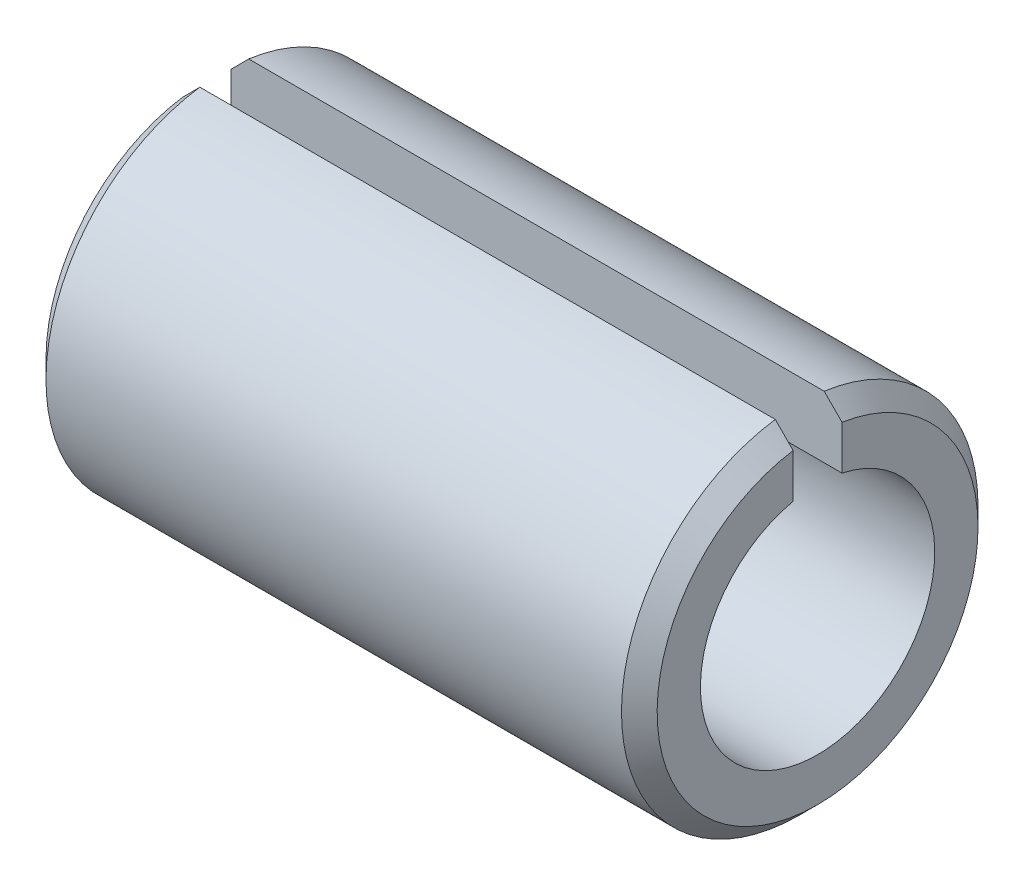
ISO-10303-21;
HEADER;
FILE_DESCRIPTION(('STEP AP214'),'2;1');
FILE_NAME('part.step','',(''),(''),'','','');
FILE_SCHEMA(('AUTOMOTIVE_DESIGN { 1 0 10303 214 1 1 1 1 }'));
ENDSEC;
DATA;
#1=APPLICATION_CONTEXT('core data for automotive mechanical design processes');
#2=APPLICATION_PROTOCOL_DEFINITION('international standard','automotive_design',2000,#1);
#3=PRODUCT_CONTEXT('',#1,'mechanical');
#4=PRODUCT('Part','Part','',(#3));
#5=PRODUCT_RELATED_PRODUCT_CATEGORY('part','',(#4));
#6=PRODUCT_DEFINITION_FORMATION('','',#4);
#7=PRODUCT_DEFINITION_CONTEXT('part definition',#1,'design');
#8=PRODUCT_DEFINITION('design','',#6,#7);
#9=PRODUCT_DEFINITION_SHAPE('','',#8);
#10=(LENGTH_UNIT() NAMED_UNIT(*) SI_UNIT(.MILLI.,.METRE.));
#11=(NAMED_UNIT(*) PLANE_ANGLE_UNIT() SI_UNIT($,.RADIAN.));
#12=(NAMED_UNIT(*) SI_UNIT($,.STERADIAN.) SOLID_ANGLE_UNIT());
#13=UNCERTAINTY_MEASURE_WITH_UNIT(LENGTH_MEASURE(1.E-05),#10,'distance_accuracy_value','');
#14=(GEOMETRIC_REPRESENTATION_CONTEXT(3) GLOBAL_UNCERTAINTY_ASSIGNED_CONTEXT((#13)) GLOBAL_UNIT_ASSIGNED_CONTEXT((#10,
#11,#12)) REPRESENTATION_CONTEXT('',''));
#15=CARTESIAN_POINT('',(0.,0.,0.));
#16=DIRECTION('',(0.,0.,1.));
#17=DIRECTION('',(1.,0.,0.));
#18=AXIS2_PLACEMENT_3D('',#15,#16,#17);
#19=CARTESIAN_POINT('',(0.,0.,0.));
#20=DIRECTION('',(-1.,0.,0.));
#21=DIRECTION('',(0.,0.,1.));
#22=AXIS2_PLACEMENT_3D('',#19,#20,#21);
#23=CYLINDRICAL_SURFACE('',#22,1.15);
#24=DIRECTION('',(-1.,0.,0.));
#25=VECTOR('',#24,1.);
#26=CARTESIAN_POINT('',(6.,1.12467773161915,0.24));
#27=LINE('',#26,#25);
#28=CARTESIAN_POINT('',(6.,1.12467773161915,0.24));
#29=VERTEX_POINT('',#28);
#30=CARTESIAN_POINT('',(0.,1.12467773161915,0.24));
#31=VERTEX_POINT('',#30);
#32=EDGE_CURVE('E49',#29,#31,#27,.T.);
#33=ORIENTED_EDGE('',*,*,#32,.F.);
#34=CARTESIAN_POINT('',(6.,0.,0.));
#35=DIRECTION('',(-1.,0.,0.));
#36=DIRECTION('',(0.,0.,1.));
#37=AXIS2_PLACEMENT_3D('',#34,#35,#36);
#38=CIRCLE('',#37,1.15);
#39=CARTESIAN_POINT('',(6.,1.12467773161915,-0.24));
#40=VERTEX_POINT('',#39);
#41=EDGE_CURVE('E98',#40,#29,#38,.T.);
#42=ORIENTED_EDGE('',*,*,#41,.F.);
#43=DIRECTION('',(-1.,0.,0.));
#44=VECTOR('',#43,1.);
#45=CARTESIAN_POINT('',(6.,1.12467773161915,-0.24));
#46=LINE('',#45,#44);
#47=CARTESIAN_POINT('',(0.,1.12467773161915,-0.24));
#48=VERTEX_POINT('',#47);
#49=EDGE_CURVE('E102',#40,#48,#46,.T.);
#50=ORIENTED_EDGE('',*,*,#49,.T.);
#51=CARTESIAN_POINT('',(0.,0.,0.));
#52=DIRECTION('',(-1.,0.,0.));
#53=DIRECTION('',(0.,0.,1.));
#54=AXIS2_PLACEMENT_3D('',#51,#52,#53);
#55=CIRCLE('',#54,1.15);
#56=EDGE_CURVE('E100',#48,#31,#55,.T.);
#57=ORIENTED_EDGE('',*,*,#56,.T.);
#58=EDGE_LOOP('',(#33,#42,#50,#57));
#59=FACE_BOUND('',#58,.T.);
#60=ADVANCED_FACE('F35',(#59),#23,.F.);
#61=CARTESIAN_POINT('',(6.,1.15,0.));
#62=DIRECTION('',(-1.,0.,0.));
#63=DIRECTION('',(0.,0.,1.));
#64=AXIS2_PLACEMENT_3D('',#61,#62,#63);
#65=PLANE('',#64);
#66=DIRECTION('',(0.,-1.,0.));
#67=VECTOR('',#66,1.);
#68=CARTESIAN_POINT('',(6.,1.73346473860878,0.24));
#69=LINE('',#68,#67);
#70=CARTESIAN_POINT('',(6.,1.55660688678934,0.24));
#71=VERTEX_POINT('',#70);
#72=EDGE_CURVE('E84',#71,#29,#69,.T.);
#73=ORIENTED_EDGE('',*,*,#72,.F.);
#74=CARTESIAN_POINT('',(6.,0.,0.));
#75=DIRECTION('',(-1.,0.,0.));
#76=DIRECTION('',(0.,0.,1.));
#77=AXIS2_PLACEMENT_3D('',#74,#75,#76);
#78=CIRCLE('',#77,1.575);
#79=CARTESIAN_POINT('',(6.,1.55660688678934,-0.24));
#80=VERTEX_POINT('',#79);
#81=EDGE_CURVE('E106',#80,#71,#78,.T.);
#82=ORIENTED_EDGE('',*,*,#81,.F.);
#83=DIRECTION('',(0.,-1.,0.));
#84=VECTOR('',#83,1.);
#85=CARTESIAN_POINT('',(6.,1.73346473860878,-0.24));
#86=LINE('',#85,#84);
#87=EDGE_CURVE('E92',#80,#40,#86,.T.);
#88=ORIENTED_EDGE('',*,*,#87,.T.);
#89=ORIENTED_EDGE('',*,*,#41,.T.);
#90=EDGE_LOOP('',(#73,#82,#88,#89));
#91=FACE_BOUND('',#90,.T.);
#92=ADVANCED_FACE('F105',(#91),#65,.F.);
#93=CARTESIAN_POINT('',(6.,0.,0.));
#94=DIRECTION('',(-1.,0.,0.));
#95=DIRECTION('',(0.,0.,1.));
#96=AXIS2_PLACEMENT_3D('',#93,#94,#95);
#97=CONICAL_SURFACE('',#96,1.575,0.785398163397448);
#98=CARTESIAN_POINT('',(5.12650069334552,2.43670861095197,0.24));
#99=CARTESIAN_POINT('',(5.2693337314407,2.29313617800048,0.24));
#100=CARTESIAN_POINT('',(5.41214940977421,2.14954581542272,0.24));
#101=CARTESIAN_POINT('',(5.69754949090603,1.86214123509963,0.24));
#102=CARTESIAN_POINT('',(5.84013389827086,1.71832702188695,0.24));
#103=CARTESIAN_POINT('',(6.05369619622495,1.502290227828,0.24));
#104=CARTESIAN_POINT('',(6.12483237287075,1.43022423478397,0.24));
#105=CARTESIAN_POINT('',(6.26693271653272,1.28592374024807,0.24));
#106=CARTESIAN_POINT('',(6.33789688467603,1.21368923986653,0.24));
#107=CARTESIAN_POINT('',(6.47954755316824,1.06894420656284,0.24));
#108=CARTESIAN_POINT('',(6.55023404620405,0.996433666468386,0.24));
#109=CARTESIAN_POINT('',(6.65587272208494,0.887287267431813,0.24));
#110=CARTESIAN_POINT('',(6.69102082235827,0.850841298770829,0.24));
#111=CARTESIAN_POINT('',(6.76111764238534,0.777757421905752,0.24));
#112=CARTESIAN_POINT('',(6.79606635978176,0.741119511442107,0.24));
#113=CARTESIAN_POINT('',(6.83088058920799,0.70435338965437,0.24));
#114=B_SPLINE_CURVE_WITH_KNOTS('',3,(#98,#99,#100,#101,#102,#103,#104,#105,#106,#107,#108,#109,
#110,#111,#112,#113),.UNSPECIFIED.,.F.,.F.,(4,2,2,2,2,2,2,4),(0.,0.607560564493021,
1.21510898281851,1.51889286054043,1.82267474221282,2.12646457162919,2.27836283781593,
2.43026289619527),.UNSPECIFIED.);
#115=CARTESIAN_POINT('',(5.825,1.73346473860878,0.24));
#116=VERTEX_POINT('',#115);
#117=EDGE_CURVE('E87',#116,#71,#114,.T.);
#118=ORIENTED_EDGE('',*,*,#117,.F.);
#119=CARTESIAN_POINT('',(5.825,0.,0.));
#120=DIRECTION('',(-1.,0.,0.));
#121=DIRECTION('',(0.,0.,1.));
#122=AXIS2_PLACEMENT_3D('',#119,#120,#121);
#123=CIRCLE('',#122,1.75);
#124=CARTESIAN_POINT('',(5.825,1.73346473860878,-0.24));
#125=VERTEX_POINT('',#124);
#126=EDGE_CURVE('E108',#125,#116,#123,.T.);
#127=ORIENTED_EDGE('',*,*,#126,.F.);
#128=CARTESIAN_POINT('',(5.12650069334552,2.43670861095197,-0.24));
#129=CARTESIAN_POINT('',(5.2693337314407,2.29313617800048,-0.24));
#130=CARTESIAN_POINT('',(5.41214940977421,2.14954581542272,-0.24));
#131=CARTESIAN_POINT('',(5.69754949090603,1.86214123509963,-0.24));
#132=CARTESIAN_POINT('',(5.84013389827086,1.71832702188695,-0.24));
#133=CARTESIAN_POINT('',(6.05369619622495,1.502290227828,-0.24));
#134=CARTESIAN_POINT('',(6.12483237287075,1.43022423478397,-0.24));
#135=CARTESIAN_POINT('',(6.26693271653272,1.28592374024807,-0.24));
#136=CARTESIAN_POINT('',(6.33789688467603,1.21368923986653,-0.24));
#137=CARTESIAN_POINT('',(6.47954755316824,1.06894420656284,-0.24));
#138=CARTESIAN_POINT('',(6.55023404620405,0.996433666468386,-0.24));
#139=CARTESIAN_POINT('',(6.65587272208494,0.887287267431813,-0.24));
#140=CARTESIAN_POINT('',(6.69102082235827,0.850841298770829,-0.24));
#141=CARTESIAN_POINT('',(6.76111764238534,0.777757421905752,-0.24));
#142=CARTESIAN_POINT('',(6.79606635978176,0.741119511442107,-0.24));
#143=CARTESIAN_POINT('',(6.83088058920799,0.70435338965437,-0.24));
#144=B_SPLINE_CURVE_WITH_KNOTS('',3,(#128,#129,#130,#131,#132,#133,#134,#135,#136,#137,#138,
#139,#140,#141,#142,#143),.UNSPECIFIED.,.F.,.F.,(4,2,2,2,2,2,2,4),(0.,0.607560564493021,
1.21510898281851,1.51889286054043,1.82267474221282,2.12646457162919,2.27836283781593,
2.43026289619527),.UNSPECIFIED.);
#145=EDGE_CURVE('E156',#125,#80,#144,.T.);
#146=ORIENTED_EDGE('',*,*,#145,.T.);
#147=ORIENTED_EDGE('',*,*,#81,.T.);
#148=EDGE_LOOP('',(#118,#127,#146,#147));
#149=FACE_BOUND('',#148,.T.);
#150=ADVANCED_FACE('F132',(#149),#97,.T.);
#151=CARTESIAN_POINT('',(0.,0.,0.));
#152=DIRECTION('',(-1.,0.,0.));
#153=DIRECTION('',(0.,0.,1.));
#154=AXIS2_PLACEMENT_3D('',#151,#152,#153);
#155=CYLINDRICAL_SURFACE('',#154,1.75);
#156=DIRECTION('',(-1.,0.,0.));
#157=VECTOR('',#156,1.);
#158=CARTESIAN_POINT('',(6.,1.73346473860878,0.24));
#159=LINE('',#158,#157);
#160=CARTESIAN_POINT('',(0.175000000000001,1.73346473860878,0.24));
#161=VERTEX_POINT('',#160);
#162=EDGE_CURVE('E101',#116,#161,#159,.T.);
#163=ORIENTED_EDGE('',*,*,#162,.T.);
#164=CARTESIAN_POINT('',(0.175,0.,0.));
#165=DIRECTION('',(-1.,0.,0.));
#166=DIRECTION('',(0.,0.,1.));
#167=AXIS2_PLACEMENT_3D('',#164,#165,#166);
#168=CIRCLE('',#167,1.75);
#169=CARTESIAN_POINT('',(0.175000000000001,1.73346473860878,-0.24));
#170=VERTEX_POINT('',#169);
#171=EDGE_CURVE('E113',#170,#161,#168,.T.);
#172=ORIENTED_EDGE('',*,*,#171,.F.);
#173=DIRECTION('',(-1.,0.,0.));
#174=VECTOR('',#173,1.);
#175=CARTESIAN_POINT('',(6.,1.73346473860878,-0.24));
#176=LINE('',#175,#174);
#177=EDGE_CURVE('E169',#125,#170,#176,.T.);
#178=ORIENTED_EDGE('',*,*,#177,.F.);
#179=ORIENTED_EDGE('',*,*,#126,.T.);
#180=EDGE_LOOP('',(#163,#172,#178,#179));
#181=FACE_BOUND('',#180,.T.);
#182=ADVANCED_FACE('F148',(#181),#155,.T.);
#183=CARTESIAN_POINT('',(0.175,0.,0.));
#184=DIRECTION('',(1.,0.,0.));
#185=DIRECTION('',(0.,0.,-1.));
#186=AXIS2_PLACEMENT_3D('',#183,#184,#185);
#187=CONICAL_SURFACE('',#186,1.75,0.785398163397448);
#188=CARTESIAN_POINT('',(-0.830880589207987,0.70435338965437,0.24));
#189=CARTESIAN_POINT('',(-0.78090794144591,0.757098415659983,0.24));
#190=CARTESIAN_POINT('',(-0.730681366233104,0.809600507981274,0.24));
#191=CARTESIAN_POINT('',(-0.629875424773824,0.914263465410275,0.24));
#192=CARTESIAN_POINT('',(-0.579296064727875,0.966424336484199,0.24));
#193=CARTESIAN_POINT('',(-0.477939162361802,1.07054998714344,0.24));
#194=CARTESIAN_POINT('',(-0.427161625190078,1.12251477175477,0.24));
#195=CARTESIAN_POINT('',(-0.325469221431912,1.22631022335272,0.24));
#196=CARTESIAN_POINT('',(-0.274554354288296,1.27814088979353,0.24));
#197=CARTESIAN_POINT('',(-0.183461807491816,1.37070435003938,0.24));
#198=CARTESIAN_POINT('',(-0.143301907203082,1.41145465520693,0.24));
#199=CARTESIAN_POINT('',(-0.0629360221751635,1.49291018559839,0.24));
#200=CARTESIAN_POINT('',(-0.0227300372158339,1.53361541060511,0.24));
#201=CARTESIAN_POINT('',(0.159869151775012,1.71832930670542,0.24));
#202=CARTESIAN_POINT('',(0.302456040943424,1.86214641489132,0.24));
#203=CARTESIAN_POINT('',(0.587855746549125,2.14955139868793,0.24));
#204=CARTESIAN_POINT('',(0.73066855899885,2.29313927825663,0.24));
#205=CARTESIAN_POINT('',(0.873499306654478,2.43670861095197,0.24));
#206=B_SPLINE_CURVE_WITH_KNOTS('',3,(#188,#189,#190,#191,#192,#193,#194,#195,#196,#197,#198,
#199,#200,#201,#202,#203,#204,#205),.UNSPECIFIED.,.F.,.F.,(4,2,2,2,2,2,2,2,4),(0.,
0.217973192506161,0.435942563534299,0.653906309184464,0.87187094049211,1.04351194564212,
1.21515377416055,1.82271356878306,2.43026275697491),.UNSPECIFIED.);
#207=CARTESIAN_POINT('',(0.,1.55660688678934,0.24));
#208=VERTEX_POINT('',#207);
#209=EDGE_CURVE('E126',#208,#161,#206,.T.);
#210=ORIENTED_EDGE('',*,*,#209,.F.);
#211=CARTESIAN_POINT('',(0.,0.,0.));
#212=DIRECTION('',(-1.,0.,0.));
#213=DIRECTION('',(0.,0.,1.));
#214=AXIS2_PLACEMENT_3D('',#211,#212,#213);
#215=CIRCLE('',#214,1.575);
#216=CARTESIAN_POINT('',(0.,1.55660688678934,-0.24));
#217=VERTEX_POINT('',#216);
#218=EDGE_CURVE('E116',#217,#208,#215,.T.);
#219=ORIENTED_EDGE('',*,*,#218,.F.);
#220=CARTESIAN_POINT('',(-0.830880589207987,0.70435338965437,-0.24));
#221=CARTESIAN_POINT('',(-0.780907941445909,0.757098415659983,-0.24));
#222=CARTESIAN_POINT('',(-0.730681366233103,0.809600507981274,-0.24));
#223=CARTESIAN_POINT('',(-0.629875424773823,0.914263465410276,-0.24));
#224=CARTESIAN_POINT('',(-0.579296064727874,0.9664243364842,-0.24));
#225=CARTESIAN_POINT('',(-0.477939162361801,1.07054998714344,-0.24));
#226=CARTESIAN_POINT('',(-0.427161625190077,1.12251477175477,-0.24));
#227=CARTESIAN_POINT('',(-0.325469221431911,1.22631022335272,-0.24));
#228=CARTESIAN_POINT('',(-0.274554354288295,1.27814088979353,-0.24));
#229=CARTESIAN_POINT('',(-0.183461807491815,1.37070435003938,-0.24));
#230=CARTESIAN_POINT('',(-0.143301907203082,1.41145465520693,-0.24));
#231=CARTESIAN_POINT('',(-0.0629360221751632,1.49291018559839,-0.24));
#232=CARTESIAN_POINT('',(-0.0227300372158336,1.53361541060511,-0.24));
#233=CARTESIAN_POINT('',(0.159869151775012,1.71832930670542,-0.24));
#234=CARTESIAN_POINT('',(0.302456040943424,1.86214641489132,-0.24));
#235=CARTESIAN_POINT('',(0.587855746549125,2.14955139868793,-0.24));
#236=CARTESIAN_POINT('',(0.73066855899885,2.29313927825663,-0.24));
#237=CARTESIAN_POINT('',(0.873499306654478,2.43670861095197,-0.24));
#238=B_SPLINE_CURVE_WITH_KNOTS('',3,(#220,#221,#222,#223,#224,#225,#226,#227,#228,#229,#230,
#231,#232,#233,#234,#235,#236,#237),.UNSPECIFIED.,.F.,.F.,(4,2,2,2,2,2,2,2,4),(0.,
0.217973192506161,0.435942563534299,0.653906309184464,0.871870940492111,1.04351194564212,
1.21515377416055,1.82271356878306,2.43026275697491),.UNSPECIFIED.);
#239=EDGE_CURVE('E56',#217,#170,#238,.T.);
#240=ORIENTED_EDGE('',*,*,#239,.T.);
#241=ORIENTED_EDGE('',*,*,#171,.T.);
#242=EDGE_LOOP('',(#210,#219,#240,#241));
#243=FACE_BOUND('',#242,.T.);
#244=ADVANCED_FACE('F144',(#243),#187,.T.);
#245=CARTESIAN_POINT('',(0.,1.15,0.));
#246=DIRECTION('',(-1.,0.,0.));
#247=DIRECTION('',(0.,0.,1.));
#248=AXIS2_PLACEMENT_3D('',#245,#246,#247);
#249=PLANE('',#248);
#250=ORIENTED_EDGE('',*,*,#218,.T.);
#251=DIRECTION('',(0.,-1.,0.));
#252=VECTOR('',#251,1.);
#253=CARTESIAN_POINT('',(0.,1.15,0.24));
#254=LINE('',#253,#252);
#255=EDGE_CURVE('E11',#208,#31,#254,.T.);
#256=ORIENTED_EDGE('',*,*,#255,.T.);
#257=ORIENTED_EDGE('',*,*,#56,.F.);
#258=DIRECTION('',(0.,-1.,0.));
#259=VECTOR('',#258,1.);
#260=CARTESIAN_POINT('',(0.,1.15,-0.24));
#261=LINE('',#260,#259);
#262=EDGE_CURVE('E42',#217,#48,#261,.T.);
#263=ORIENTED_EDGE('',*,*,#262,.F.);
#264=EDGE_LOOP('',(#250,#256,#257,#263));
#265=FACE_BOUND('',#264,.T.);
#266=ADVANCED_FACE('F141',(#265),#249,.T.);
#267=CARTESIAN_POINT('',(6.,1.73346473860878,-0.24));
#268=DIRECTION('',(0.,0.,-1.));
#269=DIRECTION('',(-1.,0.,0.));
#270=AXIS2_PLACEMENT_3D('',#267,#268,#269);
#271=PLANE('',#270);
#272=ORIENTED_EDGE('',*,*,#177,.T.);
#273=ORIENTED_EDGE('',*,*,#239,.F.);
#274=ORIENTED_EDGE('',*,*,#262,.T.);
#275=ORIENTED_EDGE('',*,*,#49,.F.);
#276=ORIENTED_EDGE('',*,*,#87,.F.);
#277=ORIENTED_EDGE('',*,*,#145,.F.);
#278=EDGE_LOOP('',(#272,#273,#274,#275,#276,#277));
#279=FACE_BOUND('',#278,.T.);
#280=ADVANCED_FACE('F139',(#279),#271,.F.);
#281=CARTESIAN_POINT('',(6.,1.73346473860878,0.24));
#282=DIRECTION('',(0.,0.,-1.));
#283=DIRECTION('',(-1.,0.,0.));
#284=AXIS2_PLACEMENT_3D('',#281,#282,#283);
#285=PLANE('',#284);
#286=ORIENTED_EDGE('',*,*,#117,.T.);
#287=ORIENTED_EDGE('',*,*,#72,.T.);
#288=ORIENTED_EDGE('',*,*,#32,.T.);
#289=ORIENTED_EDGE('',*,*,#255,.F.);
#290=ORIENTED_EDGE('',*,*,#209,.T.);
#291=ORIENTED_EDGE('',*,*,#162,.F.);
#292=EDGE_LOOP('',(#286,#287,#288,#289,#290,#291));
#293=FACE_BOUND('',#292,.T.);
#294=ADVANCED_FACE('F85',(#293),#285,.T.);
#295=CLOSED_SHELL('',(#60,#92,#150,#182,#244,#266,#280,#294));
#296=MANIFOLD_SOLID_BREP('B2',#295);
#297=ADVANCED_BREP_SHAPE_REPRESENTATION('',(#18,#296),#14);
#298=SHAPE_DEFINITION_REPRESENTATION(#9,#297);
ENDSEC;
END-ISO-10303-21;
